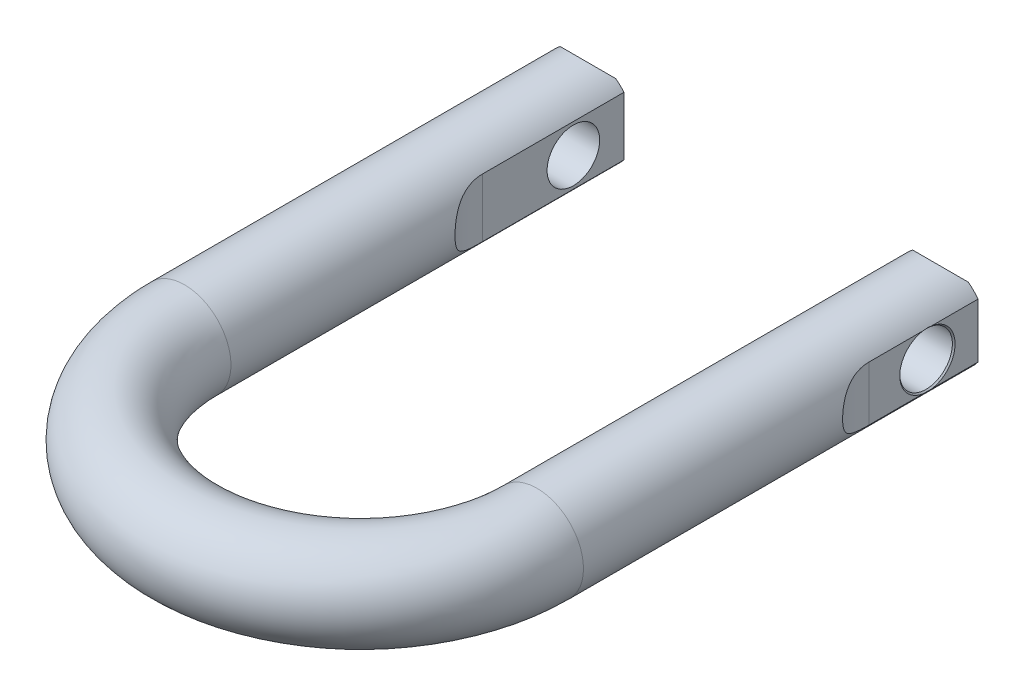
ISO-10303-21;
HEADER;
FILE_DESCRIPTION(('STEP AP214'),'2;1');
FILE_NAME('part.step','',(''),(''),'','','');
FILE_SCHEMA(('AUTOMOTIVE_DESIGN { 1 0 10303 214 1 1 1 1 }'));
ENDSEC;
DATA;
#1=APPLICATION_CONTEXT('core data for automotive mechanical design processes');
#2=APPLICATION_PROTOCOL_DEFINITION('international standard','automotive_design',2000,#1);
#3=PRODUCT_CONTEXT('',#1,'mechanical');
#4=PRODUCT('Part','Part','',(#3));
#5=PRODUCT_RELATED_PRODUCT_CATEGORY('part','',(#4));
#6=PRODUCT_DEFINITION_FORMATION('','',#4);
#7=PRODUCT_DEFINITION_CONTEXT('part definition',#1,'design');
#8=PRODUCT_DEFINITION('design','',#6,#7);
#9=PRODUCT_DEFINITION_SHAPE('','',#8);
#10=(LENGTH_UNIT() NAMED_UNIT(*) SI_UNIT(.MILLI.,.METRE.));
#11=(NAMED_UNIT(*) PLANE_ANGLE_UNIT() SI_UNIT($,.RADIAN.));
#12=(NAMED_UNIT(*) SI_UNIT($,.STERADIAN.) SOLID_ANGLE_UNIT());
#13=UNCERTAINTY_MEASURE_WITH_UNIT(LENGTH_MEASURE(1.E-05),#10,'distance_accuracy_value','');
#14=(GEOMETRIC_REPRESENTATION_CONTEXT(3) GLOBAL_UNCERTAINTY_ASSIGNED_CONTEXT((#13)) GLOBAL_UNIT_ASSIGNED_CONTEXT((#10,
#11,#12)) REPRESENTATION_CONTEXT('',''));
#15=CARTESIAN_POINT('',(0.,0.,0.));
#16=DIRECTION('',(0.,0.,1.));
#17=DIRECTION('',(1.,0.,0.));
#18=AXIS2_PLACEMENT_3D('',#15,#16,#17);
#19=CARTESIAN_POINT('',(73.1774,0.,0.));
#20=DIRECTION('',(1.,0.,0.));
#21=DIRECTION('',(0.,1.,0.));
#22=AXIS2_PLACEMENT_3D('',#19,#20,#21);
#23=CONICAL_SURFACE('',#22,9.4615,0.785398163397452);
#24=CARTESIAN_POINT('',(72.7159,0.,0.));
#25=DIRECTION('',(1.,0.,0.));
#26=DIRECTION('',(0.,1.,0.));
#27=AXIS2_PLACEMENT_3D('',#24,#25,#26);
#28=CIRCLE('',#27,9.);
#29=CARTESIAN_POINT('',(72.7159,9.,0.));
#30=VERTEX_POINT('',#29);
#31=EDGE_CURVE('E348',#30,#30,#28,.F.);
#32=ORIENTED_EDGE('',*,*,#31,.T.);
#33=EDGE_LOOP('',(#32));
#34=FACE_BOUND('',#33,.T.);
#35=CARTESIAN_POINT('',(73.1774,9.33583038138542,1.53696237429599));
#36=CARTESIAN_POINT('',(73.1597659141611,9.36004707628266,1.28153354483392));
#37=CARTESIAN_POINT('',(73.1464784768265,9.37821289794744,1.02522711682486));
#38=CARTESIAN_POINT('',(73.1287660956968,9.40237433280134,0.512611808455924));
#39=CARTESIAN_POINT('',(73.1243111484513,9.40841114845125,0.256305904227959));
#40=CARTESIAN_POINT('',(73.1243111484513,9.40841114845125,-0.256305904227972));
#41=CARTESIAN_POINT('',(73.1287660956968,9.40237433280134,-0.512611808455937));
#42=CARTESIAN_POINT('',(73.1464784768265,9.37821289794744,-1.02522711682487));
#43=CARTESIAN_POINT('',(73.1597659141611,9.36004707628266,-1.28153354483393));
#44=CARTESIAN_POINT('',(73.1774,9.33583038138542,-1.536962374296));
#45=B_SPLINE_CURVE_WITH_KNOTS('',3,(#35,#36,#37,#38,#39,#40,#41,#42,#43,#44),.UNSPECIFIED.,.F.,
.F.,(4,2,2,2,4),(0.,0.771435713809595,1.54024638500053,2.30905705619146,3.08049277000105),.UNSPECIFIED.);
#46=CARTESIAN_POINT('',(73.1774,9.33583038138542,1.53696237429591));
#47=VERTEX_POINT('',#46);
#48=CARTESIAN_POINT('',(73.1774,9.33583038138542,-1.53696237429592));
#49=VERTEX_POINT('',#48);
#50=EDGE_CURVE('E67',#47,#49,#45,.T.);
#51=ORIENTED_EDGE('',*,*,#50,.F.);
#52=CARTESIAN_POINT('',(73.1774,0.,0.));
#53=DIRECTION('',(1.,0.,0.));
#54=DIRECTION('',(0.,1.,0.));
#55=AXIS2_PLACEMENT_3D('',#52,#53,#54);
#56=CIRCLE('',#55,9.4615);
#57=CARTESIAN_POINT('',(73.1774,-9.33583038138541,1.53696237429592));
#58=VERTEX_POINT('',#57);
#59=EDGE_CURVE('E160',#47,#58,#56,.T.);
#60=ORIENTED_EDGE('',*,*,#59,.T.);
#61=CARTESIAN_POINT('',(73.1774,-9.33583038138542,-1.536962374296));
#62=CARTESIAN_POINT('',(73.1597659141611,-9.36004707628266,-1.28153354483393));
#63=CARTESIAN_POINT('',(73.1464784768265,-9.37821289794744,-1.02522711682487));
#64=CARTESIAN_POINT('',(73.1287660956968,-9.40237433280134,-0.512611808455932));
#65=CARTESIAN_POINT('',(73.1243111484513,-9.40841114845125,-0.256305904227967));
#66=CARTESIAN_POINT('',(73.1243111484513,-9.40841114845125,0.256305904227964));
#67=CARTESIAN_POINT('',(73.1287660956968,-9.40237433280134,0.512611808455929));
#68=CARTESIAN_POINT('',(73.1464784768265,-9.37821289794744,1.02522711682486));
#69=CARTESIAN_POINT('',(73.1597659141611,-9.36004707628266,1.28153354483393));
#70=CARTESIAN_POINT('',(73.1774,-9.33583038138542,1.536962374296));
#71=B_SPLINE_CURVE_WITH_KNOTS('',3,(#61,#62,#63,#64,#65,#66,#67,#68,#69,#70),.UNSPECIFIED.,.F.,
.F.,(4,2,2,2,4),(0.,0.771435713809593,1.54024638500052,2.30905705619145,3.08049277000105),.UNSPECIFIED.);
#72=CARTESIAN_POINT('',(73.1774,-9.33583038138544,-1.53696237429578));
#73=VERTEX_POINT('',#72);
#74=EDGE_CURVE('E346',#73,#58,#71,.T.);
#75=ORIENTED_EDGE('',*,*,#74,.F.);
#76=CARTESIAN_POINT('',(73.1774,0.,0.));
#77=DIRECTION('',(1.,0.,0.));
#78=DIRECTION('',(0.,1.,0.));
#79=AXIS2_PLACEMENT_3D('',#76,#77,#78);
#80=CIRCLE('',#79,9.4615);
#81=EDGE_CURVE('E158',#73,#49,#80,.T.);
#82=ORIENTED_EDGE('',*,*,#81,.T.);
#83=EDGE_LOOP('',(#51,#60,#75,#82));
#84=FACE_BOUND('',#83,.T.);
#85=ADVANCED_FACE('F14',(#34,#84),#23,.F.);
#86=CARTESIAN_POINT('',(-73.1774,0.,0.));
#87=DIRECTION('',(-1.,0.,0.));
#88=DIRECTION('',(0.,-1.,0.));
#89=AXIS2_PLACEMENT_3D('',#86,#87,#88);
#90=CONICAL_SURFACE('',#89,9.4615,0.785398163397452);
#91=CARTESIAN_POINT('',(-72.7159,0.,0.));
#92=DIRECTION('',(-1.,0.,0.));
#93=DIRECTION('',(0.,-1.,0.));
#94=AXIS2_PLACEMENT_3D('',#91,#92,#93);
#95=CIRCLE('',#94,9.);
#96=CARTESIAN_POINT('',(-72.7159,-9.,0.));
#97=VERTEX_POINT('',#96);
#98=EDGE_CURVE('E358',#97,#97,#95,.F.);
#99=ORIENTED_EDGE('',*,*,#98,.T.);
#100=EDGE_LOOP('',(#99));
#101=FACE_BOUND('',#100,.T.);
#102=CARTESIAN_POINT('',(-73.1774,-9.33583038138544,1.53696237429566));
#103=CARTESIAN_POINT('',(-73.1597659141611,-9.36004707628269,1.28153354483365));
#104=CARTESIAN_POINT('',(-73.1464784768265,-9.37821289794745,1.02522711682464));
#105=CARTESIAN_POINT('',(-73.1287660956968,-9.40237433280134,0.512611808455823));
#106=CARTESIAN_POINT('',(-73.1243111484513,-9.40841114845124,0.256305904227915));
#107=CARTESIAN_POINT('',(-73.1243111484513,-9.40841114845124,-0.256305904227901));
#108=CARTESIAN_POINT('',(-73.1287660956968,-9.40237433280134,-0.51261180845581));
#109=CARTESIAN_POINT('',(-73.1464784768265,-9.37821289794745,-1.02522711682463));
#110=CARTESIAN_POINT('',(-73.1597659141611,-9.36004707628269,-1.28153354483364));
#111=CARTESIAN_POINT('',(-73.1774,-9.33583038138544,-1.53696237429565));
#112=B_SPLINE_CURVE_WITH_KNOTS('',3,(#102,#103,#104,#105,#106,#107,#108,#109,#110,#111),
.UNSPECIFIED.,.F.,.F.,(4,2,2,2,4),(0.,0.77143571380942,1.54024638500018,2.30905705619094,
3.08049277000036),.UNSPECIFIED.);
#113=CARTESIAN_POINT('',(-73.1774,-9.33583038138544,1.53696237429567));
#114=VERTEX_POINT('',#113);
#115=CARTESIAN_POINT('',(-73.1774,-9.33583038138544,-1.53696237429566));
#116=VERTEX_POINT('',#115);
#117=EDGE_CURVE('E168',#114,#116,#112,.T.);
#118=ORIENTED_EDGE('',*,*,#117,.F.);
#119=CARTESIAN_POINT('',(-73.1774,0.,0.));
#120=DIRECTION('',(-1.,0.,0.));
#121=DIRECTION('',(0.,-1.,0.));
#122=AXIS2_PLACEMENT_3D('',#119,#120,#121);
#123=CIRCLE('',#122,9.4615);
#124=CARTESIAN_POINT('',(-73.1774,9.33583038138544,1.53696237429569));
#125=VERTEX_POINT('',#124);
#126=EDGE_CURVE('E150',#114,#125,#123,.T.);
#127=ORIENTED_EDGE('',*,*,#126,.T.);
#128=CARTESIAN_POINT('',(-73.1774,9.33583038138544,-1.53696237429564));
#129=CARTESIAN_POINT('',(-73.1597659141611,9.36004707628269,-1.28153354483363));
#130=CARTESIAN_POINT('',(-73.1464784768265,9.37821289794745,-1.02522711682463));
#131=CARTESIAN_POINT('',(-73.1287660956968,9.40237433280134,-0.512611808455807));
#132=CARTESIAN_POINT('',(-73.1243111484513,9.40841114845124,-0.256305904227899));
#133=CARTESIAN_POINT('',(-73.1243111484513,9.40841114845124,0.256305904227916));
#134=CARTESIAN_POINT('',(-73.1287660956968,9.40237433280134,0.512611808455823));
#135=CARTESIAN_POINT('',(-73.1464784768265,9.37821289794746,1.02522711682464));
#136=CARTESIAN_POINT('',(-73.1597659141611,9.36004707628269,1.28153354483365));
#137=CARTESIAN_POINT('',(-73.1774,9.33583038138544,1.53696237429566));
#138=B_SPLINE_CURVE_WITH_KNOTS('',3,(#128,#129,#130,#131,#132,#133,#134,#135,#136,#137),
.UNSPECIFIED.,.F.,.F.,(4,2,2,2,4),(0.,0.77143571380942,1.54024638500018,2.30905705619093,
3.08049277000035),.UNSPECIFIED.);
#139=CARTESIAN_POINT('',(-73.1774,9.33583038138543,-1.5369623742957));
#140=VERTEX_POINT('',#139);
#141=EDGE_CURVE('E33',#140,#125,#138,.T.);
#142=ORIENTED_EDGE('',*,*,#141,.F.);
#143=CARTESIAN_POINT('',(-73.1774,0.,0.));
#144=DIRECTION('',(-1.,0.,0.));
#145=DIRECTION('',(0.,-1.,0.));
#146=AXIS2_PLACEMENT_3D('',#143,#144,#145);
#147=CIRCLE('',#146,9.4615);
#148=EDGE_CURVE('E267',#140,#116,#147,.T.);
#149=ORIENTED_EDGE('',*,*,#148,.T.);
#150=EDGE_LOOP('',(#118,#127,#142,#149));
#151=FACE_BOUND('',#150,.T.);
#152=ADVANCED_FACE('F174',(#101,#151),#90,.F.);
#153=CARTESIAN_POINT('',(-88.9,-7.64764237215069,-22.3624576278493));
#154=DIRECTION('',(0.,0.707106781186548,0.707106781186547));
#155=DIRECTION('',(0.,-0.707106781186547,0.707106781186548));
#156=AXIS2_PLACEMENT_3D('',#153,#154,#155);
#157=PLANE('',#156);
#158=CARTESIAN_POINT('',(-60.3377,0.,-30.0101));
#159=DIRECTION('',(0.,0.707106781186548,0.707106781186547));
#160=DIRECTION('',(0.,0.707106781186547,-0.707106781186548));
#161=AXIS2_PLACEMENT_3D('',#158,#159,#160);
#162=ELLIPSE('',#161,22.4506403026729,15.875);
#163=CARTESIAN_POINT('',(-69.8627,-12.7,-17.3101));
#164=VERTEX_POINT('',#163);
#165=CARTESIAN_POINT('',(-50.8127,-12.7,-17.3101));
#166=VERTEX_POINT('',#165);
#167=EDGE_CURVE('E264',#164,#166,#162,.T.);
#168=ORIENTED_EDGE('',*,*,#167,.F.);
#169=DIRECTION('',(1.,0.,0.));
#170=VECTOR('',#169,1.);
#171=CARTESIAN_POINT('',(-60.3377,-12.7,-17.3101));
#172=LINE('',#171,#170);
#173=EDGE_CURVE('E271',#166,#164,#172,.F.);
#174=ORIENTED_EDGE('',*,*,#173,.F.);
#175=EDGE_LOOP('',(#168,#174));
#176=FACE_BOUND('',#175,.T.);
#177=ADVANCED_FACE('F382',(#176),#157,.F.);
#178=CARTESIAN_POINT('',(-88.9,-7.64764237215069,-22.3624576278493));
#179=DIRECTION('',(0.,0.707106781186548,0.707106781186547));
#180=DIRECTION('',(0.,-0.707106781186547,0.707106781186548));
#181=AXIS2_PLACEMENT_3D('',#178,#179,#180);
#182=PLANE('',#181);
#183=CARTESIAN_POINT('',(60.3377,0.,-30.0101));
#184=DIRECTION('',(0.,0.707106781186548,0.707106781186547));
#185=DIRECTION('',(0.,0.707106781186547,-0.707106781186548));
#186=AXIS2_PLACEMENT_3D('',#183,#184,#185);
#187=ELLIPSE('',#186,22.4506403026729,15.875);
#188=CARTESIAN_POINT('',(50.8127,-12.7,-17.3101));
#189=VERTEX_POINT('',#188);
#190=CARTESIAN_POINT('',(69.8627,-12.7,-17.3101));
#191=VERTEX_POINT('',#190);
#192=EDGE_CURVE('E129',#189,#191,#187,.T.);
#193=ORIENTED_EDGE('',*,*,#192,.F.);
#194=DIRECTION('',(1.,0.,0.));
#195=VECTOR('',#194,1.);
#196=CARTESIAN_POINT('',(60.3377,-12.7,-17.3101));
#197=LINE('',#196,#195);
#198=EDGE_CURVE('E132',#189,#191,#197,.T.);
#199=ORIENTED_EDGE('',*,*,#198,.T.);
#200=EDGE_LOOP('',(#193,#199));
#201=FACE_BOUND('',#200,.T.);
#202=ADVANCED_FACE('F131',(#201),#182,.F.);
#203=CARTESIAN_POINT('',(73.1774,25.4,-37.7792493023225));
#204=DIRECTION('',(-1.,0.,0.));
#205=DIRECTION('',(0.,0.,-1.));
#206=AXIS2_PLACEMENT_3D('',#203,#204,#205);
#207=PLANE('',#206);
#208=DIRECTION('',(0.,0.,-1.));
#209=VECTOR('',#208,1.);
#210=CARTESIAN_POINT('',(73.1774,9.33583038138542,120.7897));
#211=LINE('',#210,#209);
#212=CARTESIAN_POINT('',(73.1774,9.33583038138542,20.0279));
#213=VERTEX_POINT('',#212);
#214=EDGE_CURVE('E75',#213,#47,#211,.T.);
#215=ORIENTED_EDGE('',*,*,#214,.F.);
#216=DIRECTION('',(0.,-1.,0.));
#217=VECTOR('',#216,1.);
#218=CARTESIAN_POINT('',(73.1774,25.4,20.0279));
#219=LINE('',#218,#217);
#220=CARTESIAN_POINT('',(73.1774,-9.33583038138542,20.0279));
#221=VERTEX_POINT('',#220);
#222=EDGE_CURVE('E154',#213,#221,#219,.T.);
#223=ORIENTED_EDGE('',*,*,#222,.T.);
#224=DIRECTION('',(0.,0.,-1.));
#225=VECTOR('',#224,1.);
#226=CARTESIAN_POINT('',(73.1774,-9.33583038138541,120.7897));
#227=LINE('',#226,#225);
#228=EDGE_CURVE('E324',#58,#221,#227,.F.);
#229=ORIENTED_EDGE('',*,*,#228,.F.);
#230=ORIENTED_EDGE('',*,*,#59,.F.);
#231=EDGE_LOOP('',(#215,#223,#229,#230));
#232=FACE_BOUND('',#231,.T.);
#233=ADVANCED_FACE('F487',(#232),#207,.F.);
#234=CARTESIAN_POINT('',(73.1774,25.4,-37.7792493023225));
#235=DIRECTION('',(-1.,0.,0.));
#236=DIRECTION('',(0.,0.,-1.));
#237=AXIS2_PLACEMENT_3D('',#234,#235,#236);
#238=PLANE('',#237);
#239=DIRECTION('',(0.,0.,-1.));
#240=VECTOR('',#239,1.);
#241=CARTESIAN_POINT('',(73.1774,-9.33583038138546,120.7897));
#242=LINE('',#241,#240);
#243=CARTESIAN_POINT('',(73.1774,-9.33583038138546,-17.3101));
#244=VERTEX_POINT('',#243);
#245=EDGE_CURVE('E259',#244,#73,#242,.F.);
#246=ORIENTED_EDGE('',*,*,#245,.F.);
#247=DIRECTION('',(0.,-1.,0.));
#248=VECTOR('',#247,1.);
#249=CARTESIAN_POINT('',(73.1774,0.,-17.3101));
#250=LINE('',#249,#248);
#251=CARTESIAN_POINT('',(73.1774,9.33583038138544,-17.3101));
#252=VERTEX_POINT('',#251);
#253=EDGE_CURVE('E143',#244,#252,#250,.F.);
#254=ORIENTED_EDGE('',*,*,#253,.T.);
#255=DIRECTION('',(0.,0.,-1.));
#256=VECTOR('',#255,1.);
#257=CARTESIAN_POINT('',(73.1774,9.33583038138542,120.7897));
#258=LINE('',#257,#256);
#259=EDGE_CURVE('E258',#49,#252,#258,.T.);
#260=ORIENTED_EDGE('',*,*,#259,.F.);
#261=ORIENTED_EDGE('',*,*,#81,.F.);
#262=EDGE_LOOP('',(#246,#254,#260,#261));
#263=FACE_BOUND('',#262,.T.);
#264=ADVANCED_FACE('F478',(#263),#238,.F.);
#265=CARTESIAN_POINT('',(-88.9,7.64764237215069,-22.3624576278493));
#266=DIRECTION('',(0.,-0.707106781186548,0.707106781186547));
#267=DIRECTION('',(0.,-0.707106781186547,-0.707106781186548));
#268=AXIS2_PLACEMENT_3D('',#265,#266,#267);
#269=PLANE('',#268);
#270=CARTESIAN_POINT('',(60.3377,0.,-30.0101));
#271=DIRECTION('',(0.,-0.707106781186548,0.707106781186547));
#272=DIRECTION('',(0.,-0.707106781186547,-0.707106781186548));
#273=AXIS2_PLACEMENT_3D('',#270,#271,#272);
#274=ELLIPSE('',#273,22.4506403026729,15.875);
#275=CARTESIAN_POINT('',(69.8627,12.7,-17.3101));
#276=VERTEX_POINT('',#275);
#277=CARTESIAN_POINT('',(50.8127,12.7,-17.3101));
#278=VERTEX_POINT('',#277);
#279=EDGE_CURVE('E252',#276,#278,#274,.T.);
#280=ORIENTED_EDGE('',*,*,#279,.F.);
#281=DIRECTION('',(1.,0.,0.));
#282=VECTOR('',#281,1.);
#283=CARTESIAN_POINT('',(60.3377,12.7,-17.3101));
#284=LINE('',#283,#282);
#285=EDGE_CURVE('E144',#276,#278,#284,.F.);
#286=ORIENTED_EDGE('',*,*,#285,.T.);
#287=EDGE_LOOP('',(#280,#286));
#288=FACE_BOUND('',#287,.T.);
#289=ADVANCED_FACE('F470',(#288),#269,.F.);
#290=CARTESIAN_POINT('',(60.3377,0.,-17.3101));
#291=DIRECTION('',(0.,0.,1.));
#292=DIRECTION('',(0.,-1.,0.));
#293=AXIS2_PLACEMENT_3D('',#290,#291,#292);
#294=PLANE('',#293);
#295=ORIENTED_EDGE('',*,*,#253,.F.);
#296=CARTESIAN_POINT('',(60.3377,0.,-17.3101));
#297=DIRECTION('',(0.,0.,-1.));
#298=DIRECTION('',(1.,0.,0.));
#299=AXIS2_PLACEMENT_3D('',#296,#297,#298);
#300=CIRCLE('',#299,15.875);
#301=EDGE_CURVE('E136',#191,#244,#300,.F.);
#302=ORIENTED_EDGE('',*,*,#301,.F.);
#303=ORIENTED_EDGE('',*,*,#198,.F.);
#304=CARTESIAN_POINT('',(60.3377,0.,-17.3101));
#305=DIRECTION('',(0.,0.,-1.));
#306=DIRECTION('',(1.,0.,0.));
#307=AXIS2_PLACEMENT_3D('',#304,#305,#306);
#308=CIRCLE('',#307,15.875);
#309=CARTESIAN_POINT('',(48.0314,-10.0284896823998,-17.3101));
#310=VERTEX_POINT('',#309);
#311=EDGE_CURVE('E142',#310,#189,#308,.F.);
#312=ORIENTED_EDGE('',*,*,#311,.F.);
#313=DIRECTION('',(0.,1.,0.));
#314=VECTOR('',#313,1.);
#315=CARTESIAN_POINT('',(48.0314,25.4,-17.3101));
#316=LINE('',#315,#314);
#317=CARTESIAN_POINT('',(48.0314,10.0284896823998,-17.3101));
#318=VERTEX_POINT('',#317);
#319=EDGE_CURVE('E298',#310,#318,#316,.T.);
#320=ORIENTED_EDGE('',*,*,#319,.T.);
#321=CARTESIAN_POINT('',(60.3377,0.,-17.3101));
#322=DIRECTION('',(0.,0.,-1.));
#323=DIRECTION('',(1.,0.,0.));
#324=AXIS2_PLACEMENT_3D('',#321,#322,#323);
#325=CIRCLE('',#324,15.875);
#326=EDGE_CURVE('E249',#278,#318,#325,.F.);
#327=ORIENTED_EDGE('',*,*,#326,.F.);
#328=ORIENTED_EDGE('',*,*,#285,.F.);
#329=CARTESIAN_POINT('',(60.3377,0.,-17.3101));
#330=DIRECTION('',(0.,0.,-1.));
#331=DIRECTION('',(1.,0.,0.));
#332=AXIS2_PLACEMENT_3D('',#329,#330,#331);
#333=CIRCLE('',#332,15.875);
#334=EDGE_CURVE('E255',#252,#276,#333,.F.);
#335=ORIENTED_EDGE('',*,*,#334,.F.);
#336=EDGE_LOOP('',(#295,#302,#303,#312,#320,#327,#328,#335));
#337=FACE_BOUND('',#336,.T.);
#338=ADVANCED_FACE('F141',(#337),#294,.F.);
#339=CARTESIAN_POINT('',(48.0314,25.4,-33.8404776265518));
#340=DIRECTION('',(1.,0.,0.));
#341=DIRECTION('',(0.,1.,0.));
#342=AXIS2_PLACEMENT_3D('',#339,#340,#341);
#343=PLANE('',#342);
#344=CARTESIAN_POINT('',(48.0314,0.,0.));
#345=DIRECTION('',(1.,0.,0.));
#346=DIRECTION('',(0.,1.,0.));
#347=AXIS2_PLACEMENT_3D('',#344,#345,#346);
#348=CIRCLE('',#347,9.);
#349=CARTESIAN_POINT('',(48.0314,9.,0.));
#350=VERTEX_POINT('',#349);
#351=EDGE_CURVE('E363',#350,#350,#348,.T.);
#352=ORIENTED_EDGE('',*,*,#351,.T.);
#353=EDGE_LOOP('',(#352));
#354=FACE_BOUND('',#353,.T.);
#355=DIRECTION('',(0.,0.,-1.));
#356=VECTOR('',#355,1.);
#357=CARTESIAN_POINT('',(48.0314,-10.0284896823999,120.7897));
#358=LINE('',#357,#356);
#359=CARTESIAN_POINT('',(48.0314,-10.0284896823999,31.1023));
#360=VERTEX_POINT('',#359);
#361=EDGE_CURVE('E149',#360,#310,#358,.T.);
#362=ORIENTED_EDGE('',*,*,#361,.F.);
#363=DIRECTION('',(0.,-1.,0.));
#364=VECTOR('',#363,1.);
#365=CARTESIAN_POINT('',(48.0314,25.4,31.1023));
#366=LINE('',#365,#364);
#367=CARTESIAN_POINT('',(48.0314,10.0284896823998,31.1023));
#368=VERTEX_POINT('',#367);
#369=EDGE_CURVE('E293',#360,#368,#366,.F.);
#370=ORIENTED_EDGE('',*,*,#369,.T.);
#371=DIRECTION('',(0.,0.,-1.));
#372=VECTOR('',#371,1.);
#373=CARTESIAN_POINT('',(48.0314,10.0284896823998,120.7897));
#374=LINE('',#373,#372);
#375=EDGE_CURVE('E248',#318,#368,#374,.F.);
#376=ORIENTED_EDGE('',*,*,#375,.F.);
#377=ORIENTED_EDGE('',*,*,#319,.F.);
#378=EDGE_LOOP('',(#362,#370,#376,#377));
#379=FACE_BOUND('',#378,.T.);
#380=ADVANCED_FACE('F456',(#354,#379),#343,.F.);
#381=CARTESIAN_POINT('',(22.6314,25.4,31.1023));
#382=DIRECTION('',(0.,-1.,0.));
#383=DIRECTION('',(1.,0.,0.));
#384=AXIS2_PLACEMENT_3D('',#381,#382,#383);
#385=CYLINDRICAL_SURFACE('',#384,25.4);
#386=ORIENTED_EDGE('',*,*,#369,.F.);
#387=CARTESIAN_POINT('',(48.0314,10.0284896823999,31.1023));
#388=CARTESIAN_POINT('',(48.031401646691,10.0284842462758,31.3084763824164));
#389=CARTESIAN_POINT('',(48.0288890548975,10.0254094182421,31.5146320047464));
#390=CARTESIAN_POINT('',(48.0188559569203,10.0130812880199,31.9266410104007));
#391=CARTESIAN_POINT('',(48.0113353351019,10.003827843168,32.1324943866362));
#392=CARTESIAN_POINT('',(47.9812870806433,9.96673363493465,32.7493058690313));
#393=CARTESIAN_POINT('',(47.9512730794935,9.92955895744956,33.1594046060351));
#394=CARTESIAN_POINT('',(47.8714054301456,9.82910331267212,33.978622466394));
#395=CARTESIAN_POINT('',(47.8213563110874,9.76556490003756,34.3876907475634));
#396=CARTESIAN_POINT('',(47.7023824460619,9.61113339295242,35.1978329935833));
#397=CARTESIAN_POINT('',(47.6334600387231,9.52024368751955,35.598907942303));
#398=CARTESIAN_POINT('',(47.477888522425,9.30903602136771,36.3915087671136));
#399=CARTESIAN_POINT('',(47.3911708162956,9.18860381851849,36.7829909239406));
#400=CARTESIAN_POINT('',(47.2022725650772,8.91647941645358,37.5512266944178));
#401=CARTESIAN_POINT('',(47.1000897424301,8.76478261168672,37.9279781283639));
#402=CARTESIAN_POINT('',(46.8836876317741,8.42881452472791,38.6608620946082));
#403=CARTESIAN_POINT('',(46.7695262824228,8.24469736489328,39.0170820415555));
#404=CARTESIAN_POINT('',(46.5326067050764,7.84153131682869,39.7060677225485));
#405=CARTESIAN_POINT('',(46.4098532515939,7.62250174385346,40.0388462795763));
#406=CARTESIAN_POINT('',(46.2018078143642,7.22663765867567,40.5705887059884));
#407=CARTESIAN_POINT('',(46.1175415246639,7.0597783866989,40.7774321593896));
#408=CARTESIAN_POINT('',(45.949039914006,6.70968059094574,41.1767512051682));
#409=CARTESIAN_POINT('',(45.8648045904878,6.52644603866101,41.3692302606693));
#410=CARTESIAN_POINT('',(45.6982030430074,6.14364120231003,41.7382588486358));
#411=CARTESIAN_POINT('',(45.6158374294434,5.94406567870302,41.9148032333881));
#412=CARTESIAN_POINT('',(45.4550179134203,5.52909585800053,42.2502627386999));
#413=CARTESIAN_POINT('',(45.3765640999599,5.31370120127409,42.4091774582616));
#414=CARTESIAN_POINT('',(45.2250616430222,4.86621063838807,42.7089749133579));
#415=CARTESIAN_POINT('',(45.1520605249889,4.63399637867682,42.8497055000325));
#416=CARTESIAN_POINT('',(45.0142814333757,4.1557634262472,43.1101448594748));
#417=CARTESIAN_POINT('',(44.949502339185,3.90974662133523,43.2298564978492));
#418=CARTESIAN_POINT('',(44.8302288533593,3.40600003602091,43.4468263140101));
#419=CARTESIAN_POINT('',(44.7757204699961,3.14828679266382,43.5441150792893));
#420=CARTESIAN_POINT('',(44.6786464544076,2.62315961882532,43.7153330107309));
#421=CARTESIAN_POINT('',(44.6360761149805,2.3557495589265,43.7892713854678));
#422=CARTESIAN_POINT('',(44.5551824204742,1.74498806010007,43.92867631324));
#423=CARTESIAN_POINT('',(44.520654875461,1.39953190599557,43.9872731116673));
#424=CARTESIAN_POINT('',(44.4744168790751,0.702681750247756,44.065506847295));
#425=CARTESIAN_POINT('',(44.4627071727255,0.351287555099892,44.0851425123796));
#426=CARTESIAN_POINT('',(44.4626947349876,-0.25785642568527,44.0851519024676));
#427=CARTESIAN_POINT('',(44.4689948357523,-0.51565539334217,44.0745790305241));
#428=CARTESIAN_POINT('',(44.4940024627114,-1.02901766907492,44.032390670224));
#429=CARTESIAN_POINT('',(44.5127134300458,-1.28458033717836,44.00076934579));
#430=CARTESIAN_POINT('',(44.5620345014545,-1.79134049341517,43.9167304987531));
#431=CARTESIAN_POINT('',(44.5926562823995,-2.04253344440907,43.8642925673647));
#432=CARTESIAN_POINT('',(44.6649181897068,-2.53815854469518,43.7391227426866));
#433=CARTESIAN_POINT('',(44.7065575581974,-2.78259115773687,43.6663922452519));
#434=CARTESIAN_POINT('',(44.7995084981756,-3.26183787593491,43.5016492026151));
#435=CARTESIAN_POINT('',(44.8507812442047,-3.49668613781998,43.4097138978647));
#436=CARTESIAN_POINT('',(44.9617307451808,-3.95614175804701,43.2072428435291));
#437=CARTESIAN_POINT('',(45.0214076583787,-4.18074892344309,43.0967067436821));
#438=CARTESIAN_POINT('',(45.1476074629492,-4.61828407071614,42.8580899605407));
#439=CARTESIAN_POINT('',(45.2141278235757,-4.83121632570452,42.7300157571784));
#440=CARTESIAN_POINT('',(45.3524408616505,-5.24453560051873,42.4573722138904));
#441=CARTESIAN_POINT('',(45.424235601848,-5.44491765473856,42.3127964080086));
#442=CARTESIAN_POINT('',(45.5697887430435,-5.82799058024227,42.0118201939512));
#443=CARTESIAN_POINT('',(45.6434675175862,-6.01097654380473,41.8557558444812));
#444=CARTESIAN_POINT('',(45.7927860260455,-6.36378868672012,41.5302555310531));
#445=CARTESIAN_POINT('',(45.868425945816,-6.53361361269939,41.3608182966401));
#446=CARTESIAN_POINT('',(46.0202476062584,-6.85992514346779,41.0097906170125));
#447=CARTESIAN_POINT('',(46.0964293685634,-7.01641121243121,40.8281996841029));
#448=CARTESIAN_POINT('',(46.2480164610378,-7.31605318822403,40.454100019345));
#449=CARTESIAN_POINT('',(46.323421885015,-7.45921072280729,40.2615926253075));
#450=CARTESIAN_POINT('',(46.4848429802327,-7.75545230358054,39.8335083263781));
#451=CARTESIAN_POINT('',(46.5705051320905,-7.90614332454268,39.5961405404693));
#452=CARTESIAN_POINT('',(46.7375430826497,-8.19014681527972,39.1097964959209));
#453=CARTESIAN_POINT('',(46.8189184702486,-8.32345762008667,38.8608191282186));
#454=CARTESIAN_POINT('',(46.9760587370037,-8.57344654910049,38.352704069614));
#455=CARTESIAN_POINT('',(47.0518192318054,-8.69011174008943,38.0935586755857));
#456=CARTESIAN_POINT('',(47.1965210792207,-8.90741695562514,37.5667776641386));
#457=CARTESIAN_POINT('',(47.2654616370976,-9.00805511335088,37.2991410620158));
#458=CARTESIAN_POINT('',(47.4093219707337,-9.21366365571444,36.6994964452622));
#459=CARTESIAN_POINT('',(47.4824319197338,-9.31506409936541,36.3658260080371));
#460=CARTESIAN_POINT('',(47.6159832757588,-9.49664364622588,35.6902438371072));
#461=CARTESIAN_POINT('',(47.6764221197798,-9.57681845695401,35.348330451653));
#462=CARTESIAN_POINT('',(47.7836565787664,-9.71696478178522,34.6583981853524));
#463=CARTESIAN_POINT('',(47.8304559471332,-9.77694185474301,34.3103810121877));
#464=CARTESIAN_POINT('',(47.9097565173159,-9.87754675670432,33.6100593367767));
#465=CARTESIAN_POINT('',(47.9422619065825,-9.91818025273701,33.2577561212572));
#466=CARTESIAN_POINT('',(47.9886984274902,-9.97592008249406,32.6047805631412));
#467=CARTESIAN_POINT('',(48.0047150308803,-9.99568070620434,32.3044854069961));
#468=CARTESIAN_POINT('',(48.0260628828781,-10.0219391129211,31.7035607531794));
#469=CARTESIAN_POINT('',(48.0314162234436,-10.0284643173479,31.4029332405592));
#470=CARTESIAN_POINT('',(48.0314,-10.0284896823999,31.1023));
#471=B_SPLINE_CURVE_WITH_KNOTS('',3,(#387,#388,#389,#390,#391,#392,#393,#394,#395,#396,#397,
#398,#399,#400,#401,#402,#403,#404,#405,#406,#407,#408,#409,#410,#411,#412,#413,#414,#415,#416,
#417,#418,#419,#420,#421,#422,#423,#424,#425,#426,#427,#428,#429,#430,#431,#432,#433,#434,#435,
#436,#437,#438,#439,#440,#441,#442,#443,#444,#445,#446,#447,#448,#449,#450,#451,#452,#453,#454,
#455,#456,#457,#458,#459,#460,#461,#462,#463,#464,#465,#466,#467,#468,#469,#470),.UNSPECIFIED.,
.F.,.F.,(4,2,2,2,2,2,2,2,2,2,2,2,2,2,2,2,2,2,2,2,2,2,2,2,2,2,2,2,2,2,2,2,2,2,2,2,2,2,2,2,2,4),
(0.,0.618449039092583,1.23691235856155,2.4741702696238,3.72380563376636,4.97328622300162,
6.22767696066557,7.48225261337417,8.73101771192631,9.97909431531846,10.814729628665,
11.6501628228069,12.4858649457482,13.3215860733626,14.1639003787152,15.006099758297,
15.8471433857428,16.6878549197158,17.7411503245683,18.7944801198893,19.5676582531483,
20.3410508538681,21.1152035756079,21.8893030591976,22.660347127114,23.4314057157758,
24.2021801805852,24.9732577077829,25.7271202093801,26.4810544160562,27.2350188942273,
27.9888911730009,28.8698121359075,29.7508174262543,30.6325035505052,31.5142922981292,
32.5822200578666,33.6503636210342,34.7182129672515,35.7857492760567,36.6893910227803,
37.5911586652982),.UNSPECIFIED.);
#472=EDGE_CURVE('E124',#368,#360,#471,.T.);
#473=ORIENTED_EDGE('',*,*,#472,.F.);
#474=EDGE_LOOP('',(#386,#473));
#475=FACE_BOUND('',#474,.T.);
#476=ADVANCED_FACE('F231',(#475),#385,.F.);
#477=CARTESIAN_POINT('',(98.5774,25.4,20.0279));
#478=DIRECTION('',(0.,-1.,0.));
#479=DIRECTION('',(1.,0.,0.));
#480=AXIS2_PLACEMENT_3D('',#477,#478,#479);
#481=CYLINDRICAL_SURFACE('',#480,25.4);
#482=ORIENTED_EDGE('',*,*,#222,.F.);
#483=CARTESIAN_POINT('',(73.1774,-9.33583038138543,20.0279));
#484=CARTESIAN_POINT('',(73.1773985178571,-9.33582584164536,20.2172772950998));
#485=CARTESIAN_POINT('',(73.179518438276,-9.3329177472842,20.4066360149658));
#486=CARTESIAN_POINT('',(73.1879830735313,-9.32126194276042,20.7850831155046));
#487=CARTESIAN_POINT('',(73.1943278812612,-9.31251410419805,20.9741714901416));
#488=CARTESIAN_POINT('',(73.2196766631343,-9.27745661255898,21.5407623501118));
#489=CARTESIAN_POINT('',(73.2449949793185,-9.24233295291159,21.9174965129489));
#490=CARTESIAN_POINT('',(73.3123339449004,-9.14756251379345,22.6699625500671));
#491=CARTESIAN_POINT('',(73.3545092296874,-9.08768851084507,23.045651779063));
#492=CARTESIAN_POINT('',(73.4547356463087,-8.94241553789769,23.7899033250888));
#493=CARTESIAN_POINT('',(73.5127849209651,-8.85701955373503,24.1584664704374));
#494=CARTESIAN_POINT('',(73.6437580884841,-8.65901781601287,24.8870109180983));
#495=CARTESIAN_POINT('',(73.7167347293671,-8.54631530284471,25.2469565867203));
#496=CARTESIAN_POINT('',(73.8756700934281,-8.29225207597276,25.9537518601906));
#497=CARTESIAN_POINT('',(73.9616305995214,-8.15088742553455,26.3005996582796));
#498=CARTESIAN_POINT('',(74.1437161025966,-7.83850044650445,26.9760601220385));
#499=CARTESIAN_POINT('',(74.2397965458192,-7.6676061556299,27.3047437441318));
#500=CARTESIAN_POINT('',(74.4392628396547,-7.2942640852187,27.9412692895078));
#501=CARTESIAN_POINT('',(74.5426449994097,-7.09183218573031,28.2491215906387));
#502=CARTESIAN_POINT('',(74.7195098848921,-6.72358919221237,28.7461063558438));
#503=CARTESIAN_POINT('',(74.7921131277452,-6.56643123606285,28.9420040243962));
#504=CARTESIAN_POINT('',(74.9374038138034,-6.23672418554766,29.3204575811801));
#505=CARTESIAN_POINT('',(75.0100912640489,-6.06417369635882,29.5030122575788));
#506=CARTESIAN_POINT('',(75.1539083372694,-5.70379102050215,29.8531679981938));
#507=CARTESIAN_POINT('',(75.225037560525,-5.51595496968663,30.0207652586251));
#508=CARTESIAN_POINT('',(75.3639329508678,-5.12551106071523,30.3393082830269));
#509=CARTESIAN_POINT('',(75.4316996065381,-4.92290535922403,30.4902564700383));
#510=CARTESIAN_POINT('',(75.5625942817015,-4.50191170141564,30.7751563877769));
#511=CARTESIAN_POINT('',(75.6256774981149,-4.28340321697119,30.9089511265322));
#512=CARTESIAN_POINT('',(75.7446375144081,-3.83353539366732,31.156413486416));
#513=CARTESIAN_POINT('',(75.8005180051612,-3.60218272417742,31.2700914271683));
#514=CARTESIAN_POINT('',(75.9032594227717,-3.12851518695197,31.4758947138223));
#515=CARTESIAN_POINT('',(75.9501323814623,-2.88621548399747,31.5680488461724));
#516=CARTESIAN_POINT('',(76.0333637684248,-2.39257372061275,31.7298101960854));
#517=CARTESIAN_POINT('',(76.0697267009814,-2.14123558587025,31.799427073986));
#518=CARTESIAN_POINT('',(76.1370368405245,-1.57876665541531,31.927330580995));
#519=CARTESIAN_POINT('',(76.165285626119,-1.26607014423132,31.9802510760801));
#520=CARTESIAN_POINT('',(76.2031154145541,-0.635556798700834,32.0509210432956));
#521=CARTESIAN_POINT('',(76.2126948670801,-0.317739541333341,32.0686675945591));
#522=CARTESIAN_POINT('',(76.2127039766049,0.246160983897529,32.0686756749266));
#523=CARTESIAN_POINT('',(76.20696144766,0.492275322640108,32.0580304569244));
#524=CARTESIAN_POINT('',(76.1841805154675,0.982245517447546,32.0155737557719));
#525=CARTESIAN_POINT('',(76.167138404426,1.22610060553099,31.9837553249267));
#526=CARTESIAN_POINT('',(76.1222636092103,1.70943628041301,31.8992573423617));
#527=CARTESIAN_POINT('',(76.0944184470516,1.94891147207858,31.8465536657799));
#528=CARTESIAN_POINT('',(76.0288091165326,2.42105895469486,31.7208920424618));
#529=CARTESIAN_POINT('',(75.9910457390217,2.6537317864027,31.6479357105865));
#530=CARTESIAN_POINT('',(75.9069385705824,3.10931689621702,31.4829728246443));
#531=CARTESIAN_POINT('',(75.8606361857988,3.33227011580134,31.3910579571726));
#532=CARTESIAN_POINT('',(75.7606641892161,3.76799396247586,31.1889603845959));
#533=CARTESIAN_POINT('',(75.706994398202,3.98076434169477,31.0787772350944));
#534=CARTESIAN_POINT('',(75.5937701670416,4.39476819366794,30.8413186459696));
#535=CARTESIAN_POINT('',(75.5342179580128,4.59600599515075,30.7140496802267));
#536=CARTESIAN_POINT('',(75.4107260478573,4.98612350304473,30.4436272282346));
#537=CARTESIAN_POINT('',(75.3467845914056,5.17499820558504,30.3004673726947));
#538=CARTESIAN_POINT('',(75.1554583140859,5.70866012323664,29.8600988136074));
#539=CARTESIAN_POINT('',(75.02415140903,6.03587312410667,29.5429933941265));
#540=CARTESIAN_POINT('',(74.761258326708,6.63968735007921,28.8643968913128));
#541=CARTESIAN_POINT('',(74.6296721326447,6.91628543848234,28.5029030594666));
#542=CARTESIAN_POINT('',(74.4269249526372,7.31690257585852,27.9000442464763));
#543=CARTESIAN_POINT('',(74.353072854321,7.45703978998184,27.6700582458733));
#544=CARTESIAN_POINT('',(74.2095966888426,7.72066416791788,27.1994130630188));
#545=CARTESIAN_POINT('',(74.1399730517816,7.84414963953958,26.9587527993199));
#546=CARTESIAN_POINT('',(74.0061249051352,8.07512339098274,26.4681774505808));
#547=CARTESIAN_POINT('',(73.9419053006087,8.18259720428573,26.2182542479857));
#548=CARTESIAN_POINT('',(73.8199134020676,8.38207670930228,25.710767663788));
#549=CARTESIAN_POINT('',(73.762141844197,8.47408063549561,25.4532034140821));
#550=CARTESIAN_POINT('',(73.6423669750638,8.66119608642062,24.8764323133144));
#551=CARTESIAN_POINT('',(73.5820654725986,8.75282704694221,24.5557389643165));
#552=CARTESIAN_POINT('',(73.4732230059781,8.91533595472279,23.9071381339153));
#553=CARTESIAN_POINT('',(73.4246846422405,8.98620931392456,23.5792290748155));
#554=CARTESIAN_POINT('',(73.3402039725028,9.10801860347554,22.9183742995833));
#555=CARTESIAN_POINT('',(73.3042533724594,9.15896766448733,22.5854320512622));
#556=CARTESIAN_POINT('',(73.2454564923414,9.24164615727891,21.9161358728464));
#557=CARTESIAN_POINT('',(73.2226054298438,9.27338260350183,21.5797832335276));
#558=CARTESIAN_POINT('',(73.1967794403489,9.30913302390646,21.0403689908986));
#559=CARTESIAN_POINT('',(73.1895093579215,9.31915943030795,20.8378822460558));
#560=CARTESIAN_POINT('',(73.1798221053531,9.33249964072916,20.4329015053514));
#561=CARTESIAN_POINT('',(73.1773970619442,9.33582433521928,20.2304080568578));
#562=CARTESIAN_POINT('',(73.1774,9.33583038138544,20.0279));
#563=B_SPLINE_CURVE_WITH_KNOTS('',3,(#483,#484,#485,#486,#487,#488,#489,#490,#491,#492,#493,
#494,#495,#496,#497,#498,#499,#500,#501,#502,#503,#504,#505,#506,#507,#508,#509,#510,#511,#512,
#513,#514,#515,#516,#517,#518,#519,#520,#521,#522,#523,#524,#525,#526,#527,#528,#529,#530,#531,
#532,#533,#534,#535,#536,#537,#538,#539,#540,#541,#542,#543,#544,#545,#546,#547,#548,#549,#550,
#551,#552,#553,#554,#555,#556,#557,#558,#559,#560,#561,#562),.UNSPECIFIED.,.F.,.F.,(4,2,2,2,2,2,
2,2,2,2,2,2,2,2,2,2,2,2,2,2,2,2,2,2,2,2,2,2,2,2,2,2,2,2,2,2,2,2,2,4),(0.,0.568060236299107,
1.13613296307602,2.27255985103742,3.41966008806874,4.56662617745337,5.71771751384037,
6.86896705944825,8.01534471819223,9.16114699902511,9.94473435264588,10.7283927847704,
11.5122499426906,12.2959928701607,13.0864623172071,13.8765250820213,14.6655250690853,
15.454186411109,16.4068411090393,17.3595749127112,18.0976822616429,18.8360319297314,
19.5752369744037,20.3143830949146,21.0500350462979,21.7857048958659,22.5210967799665,
23.256784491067,24.6736950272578,26.0906933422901,26.9278115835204,27.7650148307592,
28.6029699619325,29.4410206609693,30.4568396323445,31.4728829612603,32.4882555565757,
33.5032572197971,34.111699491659,34.7191522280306),.UNSPECIFIED.);
#564=EDGE_CURVE('E235',#221,#213,#563,.T.);
#565=ORIENTED_EDGE('',*,*,#564,.F.);
#566=EDGE_LOOP('',(#482,#565));
#567=FACE_BOUND('',#566,.T.);
#568=ADVANCED_FACE('F226',(#567),#481,.F.);
#569=CARTESIAN_POINT('',(-73.1774,25.4,-37.7792493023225));
#570=DIRECTION('',(1.,0.,0.));
#571=DIRECTION('',(0.,1.,0.));
#572=AXIS2_PLACEMENT_3D('',#569,#570,#571);
#573=PLANE('',#572);
#574=DIRECTION('',(0.,0.,-1.));
#575=VECTOR('',#574,1.);
#576=CARTESIAN_POINT('',(-73.1774,-9.33583038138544,120.7897));
#577=LINE('',#576,#575);
#578=CARTESIAN_POINT('',(-73.1774,-9.33583038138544,20.0279));
#579=VERTEX_POINT('',#578);
#580=EDGE_CURVE('E266',#579,#114,#577,.T.);
#581=ORIENTED_EDGE('',*,*,#580,.F.);
#582=DIRECTION('',(0.,-1.,0.));
#583=VECTOR('',#582,1.);
#584=CARTESIAN_POINT('',(-73.1774,25.4,20.0279));
#585=LINE('',#584,#583);
#586=CARTESIAN_POINT('',(-73.1774,9.33583038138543,20.0279));
#587=VERTEX_POINT('',#586);
#588=EDGE_CURVE('E152',#579,#587,#585,.F.);
#589=ORIENTED_EDGE('',*,*,#588,.T.);
#590=DIRECTION('',(0.,0.,-1.));
#591=VECTOR('',#590,1.);
#592=CARTESIAN_POINT('',(-73.1774,9.33583038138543,120.7897));
#593=LINE('',#592,#591);
#594=EDGE_CURVE('E242',#125,#587,#593,.F.);
#595=ORIENTED_EDGE('',*,*,#594,.F.);
#596=ORIENTED_EDGE('',*,*,#126,.F.);
#597=EDGE_LOOP('',(#581,#589,#595,#596));
#598=FACE_BOUND('',#597,.T.);
#599=ADVANCED_FACE('F222',(#598),#573,.F.);
#600=CARTESIAN_POINT('',(-98.5774,25.4,20.0279));
#601=DIRECTION('',(0.,-1.,0.));
#602=DIRECTION('',(1.,0.,0.));
#603=AXIS2_PLACEMENT_3D('',#600,#601,#602);
#604=CYLINDRICAL_SURFACE('',#603,25.4);
#605=ORIENTED_EDGE('',*,*,#588,.F.);
#606=CARTESIAN_POINT('',(-73.1774,9.33583038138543,20.0279));
#607=CARTESIAN_POINT('',(-73.1773985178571,9.33582584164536,20.2172772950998));
#608=CARTESIAN_POINT('',(-73.179518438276,9.3329177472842,20.4066360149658));
#609=CARTESIAN_POINT('',(-73.1879830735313,9.32126194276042,20.7850831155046));
#610=CARTESIAN_POINT('',(-73.1943278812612,9.31251410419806,20.9741714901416));
#611=CARTESIAN_POINT('',(-73.2196766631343,9.27745661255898,21.5407623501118));
#612=CARTESIAN_POINT('',(-73.2449949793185,9.24233295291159,21.9174965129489));
#613=CARTESIAN_POINT('',(-73.3123339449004,9.14756251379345,22.6699625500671));
#614=CARTESIAN_POINT('',(-73.3545092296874,9.08768851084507,23.045651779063));
#615=CARTESIAN_POINT('',(-73.4547356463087,8.94241553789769,23.7899033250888));
#616=CARTESIAN_POINT('',(-73.5127849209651,8.85701955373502,24.1584664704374));
#617=CARTESIAN_POINT('',(-73.6437580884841,8.65901781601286,24.8870109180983));
#618=CARTESIAN_POINT('',(-73.7167347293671,8.5463153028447,25.2469565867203));
#619=CARTESIAN_POINT('',(-73.8756700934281,8.29225207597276,25.9537518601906));
#620=CARTESIAN_POINT('',(-73.9616305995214,8.15088742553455,26.3005996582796));
#621=CARTESIAN_POINT('',(-74.1437161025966,7.83850044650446,26.9760601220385));
#622=CARTESIAN_POINT('',(-74.2397965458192,7.6676061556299,27.3047437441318));
#623=CARTESIAN_POINT('',(-74.4392628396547,7.2942640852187,27.9412692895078));
#624=CARTESIAN_POINT('',(-74.5426449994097,7.09183218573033,28.2491215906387));
#625=CARTESIAN_POINT('',(-74.7195098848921,6.72358919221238,28.7461063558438));
#626=CARTESIAN_POINT('',(-74.7921131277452,6.56643123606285,28.9420040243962));
#627=CARTESIAN_POINT('',(-74.9374038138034,6.23672418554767,29.3204575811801));
#628=CARTESIAN_POINT('',(-75.0100912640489,6.06417369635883,29.5030122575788));
#629=CARTESIAN_POINT('',(-75.1539083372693,5.70379102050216,29.8531679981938));
#630=CARTESIAN_POINT('',(-75.2250375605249,5.51595496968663,30.0207652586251));
#631=CARTESIAN_POINT('',(-75.3639329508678,5.12551106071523,30.3393082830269));
#632=CARTESIAN_POINT('',(-75.4316996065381,4.92290535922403,30.4902564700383));
#633=CARTESIAN_POINT('',(-75.5625942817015,4.50191170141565,30.7751563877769));
#634=CARTESIAN_POINT('',(-75.6256774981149,4.2834032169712,30.9089511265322));
#635=CARTESIAN_POINT('',(-75.7446375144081,3.83353539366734,31.156413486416));
#636=CARTESIAN_POINT('',(-75.8005180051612,3.60218272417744,31.2700914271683));
#637=CARTESIAN_POINT('',(-75.9032594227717,3.12851518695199,31.4758947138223));
#638=CARTESIAN_POINT('',(-75.9501323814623,2.8862154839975,31.5680488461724));
#639=CARTESIAN_POINT('',(-76.0333637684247,2.39257372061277,31.7298101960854));
#640=CARTESIAN_POINT('',(-76.0697267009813,2.14123558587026,31.799427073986));
#641=CARTESIAN_POINT('',(-76.1370368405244,1.57876665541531,31.927330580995));
#642=CARTESIAN_POINT('',(-76.165285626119,1.26607014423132,31.9802510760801));
#643=CARTESIAN_POINT('',(-76.2031154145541,0.63555679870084,32.0509210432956));
#644=CARTESIAN_POINT('',(-76.2126948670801,0.317739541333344,32.0686675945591));
#645=CARTESIAN_POINT('',(-76.2127039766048,-0.246160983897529,32.0686756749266));
#646=CARTESIAN_POINT('',(-76.20696144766,-0.492275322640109,32.0580304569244));
#647=CARTESIAN_POINT('',(-76.1841805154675,-0.982245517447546,32.0155737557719));
#648=CARTESIAN_POINT('',(-76.167138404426,-1.22610060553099,31.9837553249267));
#649=CARTESIAN_POINT('',(-76.1222636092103,-1.70943628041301,31.8992573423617));
#650=CARTESIAN_POINT('',(-76.0944184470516,-1.94891147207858,31.8465536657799));
#651=CARTESIAN_POINT('',(-76.0288091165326,-2.42105895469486,31.7208920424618));
#652=CARTESIAN_POINT('',(-75.9910457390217,-2.6537317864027,31.6479357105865));
#653=CARTESIAN_POINT('',(-75.9069385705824,-3.10931689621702,31.4829728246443));
#654=CARTESIAN_POINT('',(-75.8606361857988,-3.33227011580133,31.3910579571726));
#655=CARTESIAN_POINT('',(-75.7606641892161,-3.76799396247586,31.1889603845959));
#656=CARTESIAN_POINT('',(-75.706994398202,-3.98076434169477,31.0787772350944));
#657=CARTESIAN_POINT('',(-75.5937701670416,-4.39476819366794,30.8413186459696));
#658=CARTESIAN_POINT('',(-75.5342179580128,-4.59600599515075,30.7140496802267));
#659=CARTESIAN_POINT('',(-75.4107260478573,-4.98612350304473,30.4436272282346));
#660=CARTESIAN_POINT('',(-75.3467845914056,-5.17499820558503,30.3004673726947));
#661=CARTESIAN_POINT('',(-75.1554583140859,-5.70866012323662,29.8600988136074));
#662=CARTESIAN_POINT('',(-75.02415140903,-6.03587312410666,29.5429933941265));
#663=CARTESIAN_POINT('',(-74.761258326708,-6.63968735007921,28.8643968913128));
#664=CARTESIAN_POINT('',(-74.6296721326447,-6.91628543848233,28.5029030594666));
#665=CARTESIAN_POINT('',(-74.4269249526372,-7.31690257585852,27.9000442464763));
#666=CARTESIAN_POINT('',(-74.353072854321,-7.45703978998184,27.6700582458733));
#667=CARTESIAN_POINT('',(-74.2095966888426,-7.72066416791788,27.1994130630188));
#668=CARTESIAN_POINT('',(-74.1399730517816,-7.84414963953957,26.9587527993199));
#669=CARTESIAN_POINT('',(-74.0061249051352,-8.07512339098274,26.4681774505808));
#670=CARTESIAN_POINT('',(-73.9419053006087,-8.18259720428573,26.2182542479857));
#671=CARTESIAN_POINT('',(-73.8199134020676,-8.38207670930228,25.710767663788));
#672=CARTESIAN_POINT('',(-73.762141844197,-8.47408063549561,25.4532034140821));
#673=CARTESIAN_POINT('',(-73.6423669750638,-8.66119608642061,24.8764323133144));
#674=CARTESIAN_POINT('',(-73.5820654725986,-8.75282704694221,24.5557389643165));
#675=CARTESIAN_POINT('',(-73.4732230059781,-8.91533595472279,23.9071381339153));
#676=CARTESIAN_POINT('',(-73.4246846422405,-8.98620931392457,23.5792290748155));
#677=CARTESIAN_POINT('',(-73.3402039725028,-9.10801860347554,22.9183742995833));
#678=CARTESIAN_POINT('',(-73.3042533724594,-9.15896766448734,22.5854320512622));
#679=CARTESIAN_POINT('',(-73.2454564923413,-9.24164615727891,21.9161358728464));
#680=CARTESIAN_POINT('',(-73.2226054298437,-9.27338260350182,21.5797832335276));
#681=CARTESIAN_POINT('',(-73.1967794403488,-9.30913302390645,21.0403689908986));
#682=CARTESIAN_POINT('',(-73.1895093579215,-9.31915943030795,20.8378822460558));
#683=CARTESIAN_POINT('',(-73.1798221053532,-9.33249964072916,20.4329015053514));
#684=CARTESIAN_POINT('',(-73.1773970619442,-9.33582433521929,20.2304080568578));
#685=CARTESIAN_POINT('',(-73.1774,-9.33583038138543,20.0279));
#686=B_SPLINE_CURVE_WITH_KNOTS('',3,(#606,#607,#608,#609,#610,#611,#612,#613,#614,#615,#616,
#617,#618,#619,#620,#621,#622,#623,#624,#625,#626,#627,#628,#629,#630,#631,#632,#633,#634,#635,
#636,#637,#638,#639,#640,#641,#642,#643,#644,#645,#646,#647,#648,#649,#650,#651,#652,#653,#654,
#655,#656,#657,#658,#659,#660,#661,#662,#663,#664,#665,#666,#667,#668,#669,#670,#671,#672,#673,
#674,#675,#676,#677,#678,#679,#680,#681,#682,#683,#684,#685),.UNSPECIFIED.,.F.,.F.,(4,2,2,2,2,2,
2,2,2,2,2,2,2,2,2,2,2,2,2,2,2,2,2,2,2,2,2,2,2,2,2,2,2,2,2,2,2,2,2,4),(0.,0.568060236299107,
1.13613296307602,2.27255985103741,3.41966008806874,4.56662617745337,5.71771751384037,
6.86896705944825,8.01534471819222,9.16114699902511,9.94473435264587,10.7283927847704,
11.5122499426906,12.2959928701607,13.0864623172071,13.8765250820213,14.6655250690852,
15.454186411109,16.4068411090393,17.3595749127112,18.0976822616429,18.8360319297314,
19.5752369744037,20.3143830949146,21.050035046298,21.7857048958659,22.5210967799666,
23.256784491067,24.6736950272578,26.0906933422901,26.9278115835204,27.7650148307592,
28.6029699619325,29.4410206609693,30.4568396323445,31.4728829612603,32.4882555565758,
33.5032572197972,34.111699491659,34.7191522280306),.UNSPECIFIED.);
#687=EDGE_CURVE('E202',#587,#579,#686,.T.);
#688=ORIENTED_EDGE('',*,*,#687,.F.);
#689=EDGE_LOOP('',(#605,#688));
#690=FACE_BOUND('',#689,.T.);
#691=ADVANCED_FACE('F216',(#690),#604,.F.);
#692=CARTESIAN_POINT('',(-22.6314,25.4,31.1023));
#693=DIRECTION('',(0.,-1.,0.));
#694=DIRECTION('',(1.,0.,0.));
#695=AXIS2_PLACEMENT_3D('',#692,#693,#694);
#696=CYLINDRICAL_SURFACE('',#695,25.4);
#697=CARTESIAN_POINT('',(-48.0314,-10.0284896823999,31.1023));
#698=CARTESIAN_POINT('',(-48.031401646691,-10.0284842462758,31.3084763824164));
#699=CARTESIAN_POINT('',(-48.0288890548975,-10.0254094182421,31.5146320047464));
#700=CARTESIAN_POINT('',(-48.0188559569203,-10.0130812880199,31.9266410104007));
#701=CARTESIAN_POINT('',(-48.0113353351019,-10.003827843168,32.1324943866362));
#702=CARTESIAN_POINT('',(-47.9812870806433,-9.96673363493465,32.7493058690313));
#703=CARTESIAN_POINT('',(-47.9512730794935,-9.92955895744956,33.1594046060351));
#704=CARTESIAN_POINT('',(-47.8714054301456,-9.82910331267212,33.9786224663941));
#705=CARTESIAN_POINT('',(-47.8213563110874,-9.76556490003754,34.3876907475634));
#706=CARTESIAN_POINT('',(-47.7023824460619,-9.61113339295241,35.1978329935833));
#707=CARTESIAN_POINT('',(-47.6334600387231,-9.52024368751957,35.5989079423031));
#708=CARTESIAN_POINT('',(-47.477888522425,-9.30903602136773,36.3915087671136));
#709=CARTESIAN_POINT('',(-47.3911708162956,-9.18860381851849,36.7829909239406));
#710=CARTESIAN_POINT('',(-47.2022725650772,-8.91647941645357,37.5512266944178));
#711=CARTESIAN_POINT('',(-47.1000897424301,-8.76478261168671,37.9279781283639));
#712=CARTESIAN_POINT('',(-46.8836876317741,-8.4288145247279,38.6608620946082));
#713=CARTESIAN_POINT('',(-46.7695262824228,-8.24469736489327,39.0170820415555));
#714=CARTESIAN_POINT('',(-46.5326067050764,-7.84153131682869,39.7060677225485));
#715=CARTESIAN_POINT('',(-46.4098532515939,-7.62250174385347,40.0388462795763));
#716=CARTESIAN_POINT('',(-46.2018078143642,-7.22663765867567,40.5705887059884));
#717=CARTESIAN_POINT('',(-46.1175415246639,-7.0597783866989,40.7774321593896));
#718=CARTESIAN_POINT('',(-45.949039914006,-6.70968059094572,41.1767512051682));
#719=CARTESIAN_POINT('',(-45.8648045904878,-6.52644603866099,41.3692302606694));
#720=CARTESIAN_POINT('',(-45.6982030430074,-6.14364120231,41.7382588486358));
#721=CARTESIAN_POINT('',(-45.6158374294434,-5.94406567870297,41.9148032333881));
#722=CARTESIAN_POINT('',(-45.4550179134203,-5.5290958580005,42.2502627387));
#723=CARTESIAN_POINT('',(-45.3765640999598,-5.31370120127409,42.4091774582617));
#724=CARTESIAN_POINT('',(-45.2250616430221,-4.86621063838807,42.708974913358));
#725=CARTESIAN_POINT('',(-45.1520605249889,-4.63399637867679,42.8497055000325));
#726=CARTESIAN_POINT('',(-45.0142814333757,-4.15576342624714,43.1101448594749));
#727=CARTESIAN_POINT('',(-44.949502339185,-3.90974662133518,43.2298564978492));
#728=CARTESIAN_POINT('',(-44.8302288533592,-3.40600003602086,43.4468263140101));
#729=CARTESIAN_POINT('',(-44.7757204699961,-3.14828679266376,43.5441150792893));
#730=CARTESIAN_POINT('',(-44.6786464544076,-2.62315961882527,43.715333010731));
#731=CARTESIAN_POINT('',(-44.6360761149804,-2.35574955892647,43.7892713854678));
#732=CARTESIAN_POINT('',(-44.5551824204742,-1.74498806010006,43.92867631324));
#733=CARTESIAN_POINT('',(-44.520654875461,-1.39953190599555,43.9872731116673));
#734=CARTESIAN_POINT('',(-44.4744168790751,-0.702681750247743,44.0655068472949));
#735=CARTESIAN_POINT('',(-44.4627071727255,-0.351287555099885,44.0851425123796));
#736=CARTESIAN_POINT('',(-44.4626947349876,0.257856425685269,44.0851519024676));
#737=CARTESIAN_POINT('',(-44.4689948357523,0.515655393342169,44.0745790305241));
#738=CARTESIAN_POINT('',(-44.4940024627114,1.02901766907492,44.032390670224));
#739=CARTESIAN_POINT('',(-44.5127134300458,1.28458033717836,44.00076934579));
#740=CARTESIAN_POINT('',(-44.5620345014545,1.79134049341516,43.9167304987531));
#741=CARTESIAN_POINT('',(-44.5926562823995,2.04253344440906,43.8642925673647));
#742=CARTESIAN_POINT('',(-44.6649181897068,2.53815854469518,43.7391227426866));
#743=CARTESIAN_POINT('',(-44.7065575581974,2.78259115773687,43.6663922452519));
#744=CARTESIAN_POINT('',(-44.7995084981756,3.26183787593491,43.5016492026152));
#745=CARTESIAN_POINT('',(-44.8507812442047,3.49668613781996,43.4097138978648));
#746=CARTESIAN_POINT('',(-44.9617307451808,3.95614175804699,43.2072428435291));
#747=CARTESIAN_POINT('',(-45.0214076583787,4.18074892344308,43.0967067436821));
#748=CARTESIAN_POINT('',(-45.1476074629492,4.61828407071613,42.8580899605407));
#749=CARTESIAN_POINT('',(-45.2141278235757,4.83121632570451,42.7300157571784));
#750=CARTESIAN_POINT('',(-45.3524408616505,5.24453560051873,42.4573722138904));
#751=CARTESIAN_POINT('',(-45.424235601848,5.44491765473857,42.3127964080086));
#752=CARTESIAN_POINT('',(-45.5697887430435,5.82799058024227,42.0118201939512));
#753=CARTESIAN_POINT('',(-45.6434675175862,6.01097654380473,41.8557558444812));
#754=CARTESIAN_POINT('',(-45.7927860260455,6.36378868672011,41.5302555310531));
#755=CARTESIAN_POINT('',(-45.868425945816,6.53361361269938,41.3608182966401));
#756=CARTESIAN_POINT('',(-46.0202476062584,6.85992514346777,41.0097906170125));
#757=CARTESIAN_POINT('',(-46.0964293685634,7.01641121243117,40.8281996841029));
#758=CARTESIAN_POINT('',(-46.2480164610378,7.31605318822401,40.454100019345));
#759=CARTESIAN_POINT('',(-46.3234218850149,7.4592107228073,40.2615926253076));
#760=CARTESIAN_POINT('',(-46.4848429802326,7.75545230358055,39.8335083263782));
#761=CARTESIAN_POINT('',(-46.5705051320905,7.90614332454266,39.5961405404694));
#762=CARTESIAN_POINT('',(-46.7375430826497,8.19014681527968,39.109796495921));
#763=CARTESIAN_POINT('',(-46.8189184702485,8.32345762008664,38.8608191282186));
#764=CARTESIAN_POINT('',(-46.9760587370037,8.57344654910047,38.352704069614));
#765=CARTESIAN_POINT('',(-47.0518192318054,8.69011174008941,38.0935586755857));
#766=CARTESIAN_POINT('',(-47.1965210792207,8.90741695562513,37.5667776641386));
#767=CARTESIAN_POINT('',(-47.2654616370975,9.00805511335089,37.2991410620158));
#768=CARTESIAN_POINT('',(-47.4093219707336,9.21366365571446,36.6994964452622));
#769=CARTESIAN_POINT('',(-47.4824319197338,9.31506409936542,36.3658260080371));
#770=CARTESIAN_POINT('',(-47.6159832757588,9.49664364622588,35.6902438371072));
#771=CARTESIAN_POINT('',(-47.6764221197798,9.576818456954,35.3483304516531));
#772=CARTESIAN_POINT('',(-47.7836565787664,9.71696478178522,34.6583981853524));
#773=CARTESIAN_POINT('',(-47.8304559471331,9.77694185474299,34.3103810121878));
#774=CARTESIAN_POINT('',(-47.9097565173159,9.87754675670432,33.6100593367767));
#775=CARTESIAN_POINT('',(-47.9422619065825,9.91818025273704,33.2577561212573));
#776=CARTESIAN_POINT('',(-47.9886984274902,9.97592008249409,32.6047805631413));
#777=CARTESIAN_POINT('',(-48.0047150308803,9.99568070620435,32.3044854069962));
#778=CARTESIAN_POINT('',(-48.0260628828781,10.0219391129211,31.7035607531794));
#779=CARTESIAN_POINT('',(-48.0314162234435,10.0284643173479,31.4029332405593));
#780=CARTESIAN_POINT('',(-48.0314,10.0284896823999,31.1023));
#781=B_SPLINE_CURVE_WITH_KNOTS('',3,(#697,#698,#699,#700,#701,#702,#703,#704,#705,#706,#707,
#708,#709,#710,#711,#712,#713,#714,#715,#716,#717,#718,#719,#720,#721,#722,#723,#724,#725,#726,
#727,#728,#729,#730,#731,#732,#733,#734,#735,#736,#737,#738,#739,#740,#741,#742,#743,#744,#745,
#746,#747,#748,#749,#750,#751,#752,#753,#754,#755,#756,#757,#758,#759,#760,#761,#762,#763,#764,
#765,#766,#767,#768,#769,#770,#771,#772,#773,#774,#775,#776,#777,#778,#779,#780),.UNSPECIFIED.,
.F.,.F.,(4,2,2,2,2,2,2,2,2,2,2,2,2,2,2,2,2,2,2,2,2,2,2,2,2,2,2,2,2,2,2,2,2,2,2,2,2,2,2,2,2,4),
(0.,0.618449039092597,1.23691235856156,2.47417026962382,3.7238056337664,4.97328622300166,
6.22767696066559,7.48225261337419,8.73101771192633,9.97909431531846,10.814729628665,
11.6501628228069,12.4858649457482,13.3215860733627,14.1639003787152,15.0060997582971,
15.8471433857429,16.6878549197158,17.7411503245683,18.7944801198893,19.5676582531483,
20.3410508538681,21.1152035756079,21.8893030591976,22.660347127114,23.4314057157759,
24.2021801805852,24.9732577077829,25.7271202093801,26.4810544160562,27.2350188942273,
27.9888911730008,28.8698121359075,29.7508174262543,30.6325035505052,31.5142922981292,
32.5822200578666,33.6503636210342,34.7182129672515,35.7857492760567,36.6893910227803,
37.5911586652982),.UNSPECIFIED.);
#782=CARTESIAN_POINT('',(-48.0314,-10.0284896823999,31.1023));
#783=VERTEX_POINT('',#782);
#784=CARTESIAN_POINT('',(-48.0314,10.0284896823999,31.1023));
#785=VERTEX_POINT('',#784);
#786=EDGE_CURVE('E193',#783,#785,#781,.T.);
#787=ORIENTED_EDGE('',*,*,#786,.F.);
#788=DIRECTION('',(0.,-1.,0.));
#789=VECTOR('',#788,1.);
#790=CARTESIAN_POINT('',(-48.0314,25.4,31.1023));
#791=LINE('',#790,#789);
#792=EDGE_CURVE('E283',#783,#785,#791,.F.);
#793=ORIENTED_EDGE('',*,*,#792,.T.);
#794=EDGE_LOOP('',(#787,#793));
#795=FACE_BOUND('',#794,.T.);
#796=ADVANCED_FACE('F211',(#795),#696,.F.);
#797=CARTESIAN_POINT('',(-48.0314,25.4,-33.8404776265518));
#798=DIRECTION('',(-1.,0.,0.));
#799=DIRECTION('',(0.,-1.,0.));
#800=AXIS2_PLACEMENT_3D('',#797,#798,#799);
#801=PLANE('',#800);
#802=CARTESIAN_POINT('',(-48.0314,0.,0.));
#803=DIRECTION('',(-1.,0.,0.));
#804=DIRECTION('',(0.,-1.,0.));
#805=AXIS2_PLACEMENT_3D('',#802,#803,#804);
#806=CIRCLE('',#805,9.);
#807=CARTESIAN_POINT('',(-48.0314,-9.,0.));
#808=VERTEX_POINT('',#807);
#809=EDGE_CURVE('E18',#808,#808,#806,.T.);
#810=ORIENTED_EDGE('',*,*,#809,.T.);
#811=EDGE_LOOP('',(#810));
#812=FACE_BOUND('',#811,.T.);
#813=ORIENTED_EDGE('',*,*,#792,.F.);
#814=DIRECTION('',(0.,0.,1.));
#815=VECTOR('',#814,1.);
#816=CARTESIAN_POINT('',(-48.0314,-10.0284896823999,-33.8404776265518));
#817=LINE('',#816,#815);
#818=CARTESIAN_POINT('',(-48.0314,-10.0284896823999,-17.3101));
#819=VERTEX_POINT('',#818);
#820=EDGE_CURVE('E288',#819,#783,#817,.T.);
#821=ORIENTED_EDGE('',*,*,#820,.F.);
#822=DIRECTION('',(0.,-1.,0.));
#823=VECTOR('',#822,1.);
#824=CARTESIAN_POINT('',(-48.0314,0.,-17.3101));
#825=LINE('',#824,#823);
#826=CARTESIAN_POINT('',(-48.0314,10.0284896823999,-17.3101));
#827=VERTEX_POINT('',#826);
#828=EDGE_CURVE('E272',#827,#819,#825,.T.);
#829=ORIENTED_EDGE('',*,*,#828,.F.);
#830=DIRECTION('',(0.,0.,-1.));
#831=VECTOR('',#830,1.);
#832=CARTESIAN_POINT('',(-48.0314,10.0284896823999,120.7897));
#833=LINE('',#832,#831);
#834=EDGE_CURVE('E201',#785,#827,#833,.T.);
#835=ORIENTED_EDGE('',*,*,#834,.F.);
#836=EDGE_LOOP('',(#813,#821,#829,#835));
#837=FACE_BOUND('',#836,.T.);
#838=ADVANCED_FACE('F215',(#812,#837),#801,.F.);
#839=CARTESIAN_POINT('',(-88.9,7.64764237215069,-22.3624576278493));
#840=DIRECTION('',(0.,-0.707106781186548,0.707106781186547));
#841=DIRECTION('',(0.,-0.707106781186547,-0.707106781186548));
#842=AXIS2_PLACEMENT_3D('',#839,#840,#841);
#843=PLANE('',#842);
#844=DIRECTION('',(1.,0.,0.));
#845=VECTOR('',#844,1.);
#846=CARTESIAN_POINT('',(-60.3377,12.7,-17.3101));
#847=LINE('',#846,#845);
#848=CARTESIAN_POINT('',(-69.8627,12.7,-17.3101));
#849=VERTEX_POINT('',#848);
#850=CARTESIAN_POINT('',(-50.8127,12.7,-17.3101));
#851=VERTEX_POINT('',#850);
#852=EDGE_CURVE('E278',#849,#851,#847,.T.);
#853=ORIENTED_EDGE('',*,*,#852,.F.);
#854=CARTESIAN_POINT('',(-60.3377,0.,-30.0101));
#855=DIRECTION('',(0.,-0.707106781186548,0.707106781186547));
#856=DIRECTION('',(0.,-0.707106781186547,-0.707106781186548));
#857=AXIS2_PLACEMENT_3D('',#854,#855,#856);
#858=ELLIPSE('',#857,22.4506403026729,15.875);
#859=EDGE_CURVE('E306',#851,#849,#858,.T.);
#860=ORIENTED_EDGE('',*,*,#859,.F.);
#861=EDGE_LOOP('',(#853,#860));
#862=FACE_BOUND('',#861,.T.);
#863=ADVANCED_FACE('F407',(#862),#843,.F.);
#864=CARTESIAN_POINT('',(-60.3377,0.,-17.3101));
#865=DIRECTION('',(0.,0.,-1.));
#866=DIRECTION('',(1.,0.,0.));
#867=AXIS2_PLACEMENT_3D('',#864,#865,#866);
#868=PLANE('',#867);
#869=ORIENTED_EDGE('',*,*,#173,.T.);
#870=CARTESIAN_POINT('',(-60.3377,0.,-17.3101));
#871=DIRECTION('',(0.,0.,-1.));
#872=DIRECTION('',(1.,0.,0.));
#873=AXIS2_PLACEMENT_3D('',#870,#871,#872);
#874=CIRCLE('',#873,15.875);
#875=CARTESIAN_POINT('',(-73.1774,-9.33583038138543,-17.3101));
#876=VERTEX_POINT('',#875);
#877=EDGE_CURVE('E137',#876,#164,#874,.F.);
#878=ORIENTED_EDGE('',*,*,#877,.F.);
#879=DIRECTION('',(0.,1.,0.));
#880=VECTOR('',#879,1.);
#881=CARTESIAN_POINT('',(-73.1774,25.4,-17.3101));
#882=LINE('',#881,#880);
#883=CARTESIAN_POINT('',(-73.1774,9.33583038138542,-17.3101));
#884=VERTEX_POINT('',#883);
#885=EDGE_CURVE('E268',#876,#884,#882,.T.);
#886=ORIENTED_EDGE('',*,*,#885,.T.);
#887=CARTESIAN_POINT('',(-60.3377,0.,-17.3101));
#888=DIRECTION('',(0.,0.,-1.));
#889=DIRECTION('',(1.,0.,0.));
#890=AXIS2_PLACEMENT_3D('',#887,#888,#889);
#891=CIRCLE('',#890,15.875);
#892=EDGE_CURVE('E304',#849,#884,#891,.F.);
#893=ORIENTED_EDGE('',*,*,#892,.F.);
#894=ORIENTED_EDGE('',*,*,#852,.T.);
#895=CARTESIAN_POINT('',(-60.3377,0.,-17.3101));
#896=DIRECTION('',(0.,0.,-1.));
#897=DIRECTION('',(1.,0.,0.));
#898=AXIS2_PLACEMENT_3D('',#895,#896,#897);
#899=CIRCLE('',#898,15.875);
#900=EDGE_CURVE('E203',#827,#851,#899,.F.);
#901=ORIENTED_EDGE('',*,*,#900,.F.);
#902=ORIENTED_EDGE('',*,*,#828,.T.);
#903=CARTESIAN_POINT('',(-60.3377,0.,-17.3101));
#904=DIRECTION('',(0.,0.,-1.));
#905=DIRECTION('',(1.,0.,0.));
#906=AXIS2_PLACEMENT_3D('',#903,#904,#905);
#907=CIRCLE('',#906,15.875);
#908=EDGE_CURVE('E269',#819,#166,#907,.T.);
#909=ORIENTED_EDGE('',*,*,#908,.T.);
#910=EDGE_LOOP('',(#869,#878,#886,#893,#894,#901,#902,#909));
#911=FACE_BOUND('',#910,.T.);
#912=ADVANCED_FACE('F335',(#911),#868,.T.);
#913=CARTESIAN_POINT('',(-73.1774,25.4,-37.7792493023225));
#914=DIRECTION('',(1.,0.,0.));
#915=DIRECTION('',(0.,1.,0.));
#916=AXIS2_PLACEMENT_3D('',#913,#914,#915);
#917=PLANE('',#916);
#918=DIRECTION('',(0.,0.,-1.));
#919=VECTOR('',#918,1.);
#920=CARTESIAN_POINT('',(-73.1774,9.33583038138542,120.7897));
#921=LINE('',#920,#919);
#922=EDGE_CURVE('E296',#884,#140,#921,.F.);
#923=ORIENTED_EDGE('',*,*,#922,.F.);
#924=ORIENTED_EDGE('',*,*,#885,.F.);
#925=DIRECTION('',(0.,0.,-1.));
#926=VECTOR('',#925,1.);
#927=CARTESIAN_POINT('',(-73.1774,-9.33583038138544,120.7897));
#928=LINE('',#927,#926);
#929=EDGE_CURVE('E263',#116,#876,#928,.T.);
#930=ORIENTED_EDGE('',*,*,#929,.F.);
#931=ORIENTED_EDGE('',*,*,#148,.F.);
#932=EDGE_LOOP('',(#923,#924,#930,#931));
#933=FACE_BOUND('',#932,.T.);
#934=ADVANCED_FACE('F339',(#933),#917,.F.);
#935=CARTESIAN_POINT('',(60.3377,0.,120.7897));
#936=DIRECTION('',(0.,0.,-1.));
#937=DIRECTION('',(1.,0.,0.));
#938=AXIS2_PLACEMENT_3D('',#935,#936,#937);
#939=CYLINDRICAL_SURFACE('',#938,15.875);
#940=ORIENTED_EDGE('',*,*,#311,.T.);
#941=ORIENTED_EDGE('',*,*,#192,.T.);
#942=ORIENTED_EDGE('',*,*,#301,.T.);
#943=ORIENTED_EDGE('',*,*,#245,.T.);
#944=ORIENTED_EDGE('',*,*,#74,.T.);
#945=ORIENTED_EDGE('',*,*,#228,.T.);
#946=ORIENTED_EDGE('',*,*,#564,.T.);
#947=ORIENTED_EDGE('',*,*,#214,.T.);
#948=ORIENTED_EDGE('',*,*,#50,.T.);
#949=ORIENTED_EDGE('',*,*,#259,.T.);
#950=ORIENTED_EDGE('',*,*,#334,.T.);
#951=ORIENTED_EDGE('',*,*,#279,.T.);
#952=ORIENTED_EDGE('',*,*,#326,.T.);
#953=ORIENTED_EDGE('',*,*,#375,.T.);
#954=ORIENTED_EDGE('',*,*,#472,.T.);
#955=ORIENTED_EDGE('',*,*,#361,.T.);
#956=EDGE_LOOP('',(#940,#941,#942,#943,#944,#945,#946,#947,#948,#949,#950,#951,#952,#953,#954,#955));
#957=FACE_BOUND('',#956,.T.);
#958=CARTESIAN_POINT('',(60.3377,0.,120.7897));
#959=DIRECTION('',(0.,0.,1.));
#960=DIRECTION('',(1.,0.,0.));
#961=AXIS2_PLACEMENT_3D('',#958,#959,#960);
#962=CIRCLE('',#961,15.875);
#963=CARTESIAN_POINT('',(76.2127,0.,120.7897));
#964=VERTEX_POINT('',#963);
#965=EDGE_CURVE('E24',#964,#964,#962,.T.);
#966=ORIENTED_EDGE('',*,*,#965,.F.);
#967=EDGE_LOOP('',(#966));
#968=FACE_BOUND('',#967,.T.);
#969=ADVANCED_FACE('F146',(#957,#968),#939,.T.);
#970=CARTESIAN_POINT('',(-60.3377,0.,120.7897));
#971=DIRECTION('',(0.,0.,-1.));
#972=DIRECTION('',(1.,0.,0.));
#973=AXIS2_PLACEMENT_3D('',#970,#971,#972);
#974=CYLINDRICAL_SURFACE('',#973,15.875);
#975=CARTESIAN_POINT('',(-60.3377,0.,120.7897));
#976=DIRECTION('',(0.,0.,-1.));
#977=DIRECTION('',(-1.,0.,0.));
#978=AXIS2_PLACEMENT_3D('',#975,#976,#977);
#979=CIRCLE('',#978,15.875);
#980=CARTESIAN_POINT('',(-76.2127,0.,120.7897));
#981=VERTEX_POINT('',#980);
#982=EDGE_CURVE('E9',#981,#981,#979,.F.);
#983=ORIENTED_EDGE('',*,*,#982,.F.);
#984=EDGE_LOOP('',(#983));
#985=FACE_BOUND('',#984,.T.);
#986=ORIENTED_EDGE('',*,*,#922,.T.);
#987=ORIENTED_EDGE('',*,*,#141,.T.);
#988=ORIENTED_EDGE('',*,*,#594,.T.);
#989=ORIENTED_EDGE('',*,*,#687,.T.);
#990=ORIENTED_EDGE('',*,*,#580,.T.);
#991=ORIENTED_EDGE('',*,*,#117,.T.);
#992=ORIENTED_EDGE('',*,*,#929,.T.);
#993=ORIENTED_EDGE('',*,*,#877,.T.);
#994=ORIENTED_EDGE('',*,*,#167,.T.);
#995=ORIENTED_EDGE('',*,*,#908,.F.);
#996=ORIENTED_EDGE('',*,*,#820,.T.);
#997=ORIENTED_EDGE('',*,*,#786,.T.);
#998=ORIENTED_EDGE('',*,*,#834,.T.);
#999=ORIENTED_EDGE('',*,*,#900,.T.);
#1000=ORIENTED_EDGE('',*,*,#859,.T.);
#1001=ORIENTED_EDGE('',*,*,#892,.T.);
#1002=EDGE_LOOP('',(#986,#987,#988,#989,#990,#991,#992,#993,#994,#995,#996,#997,#998,#999,#1000,#1001));
#1003=FACE_BOUND('',#1002,.T.);
#1004=ADVANCED_FACE('F177',(#985,#1003),#974,.T.);
#1005=CARTESIAN_POINT('',(0.,0.,120.7897));
#1006=DIRECTION('',(0.,-1.,0.));
#1007=DIRECTION('',(1.,0.,0.));
#1008=AXIS2_PLACEMENT_3D('',#1005,#1006,#1007);
#1009=TOROIDAL_SURFACE('',#1008,60.3377,15.875);
#1010=ORIENTED_EDGE('',*,*,#982,.T.);
#1011=EDGE_LOOP('',(#1010));
#1012=FACE_BOUND('',#1011,.T.);
#1013=ORIENTED_EDGE('',*,*,#965,.T.);
#1014=EDGE_LOOP('',(#1013));
#1015=FACE_BOUND('',#1014,.T.);
#1016=ADVANCED_FACE('F182',(#1012,#1015),#1009,.T.);
#1017=CARTESIAN_POINT('',(-76.2127,0.,0.));
#1018=DIRECTION('',(1.,0.,0.));
#1019=DIRECTION('',(0.,0.,1.));
#1020=AXIS2_PLACEMENT_3D('',#1017,#1018,#1019);
#1021=CYLINDRICAL_SURFACE('',#1020,9.);
#1022=ORIENTED_EDGE('',*,*,#809,.F.);
#1023=EDGE_LOOP('',(#1022));
#1024=FACE_BOUND('',#1023,.T.);
#1025=ORIENTED_EDGE('',*,*,#98,.F.);
#1026=EDGE_LOOP('',(#1025));
#1027=FACE_BOUND('',#1026,.T.);
#1028=ADVANCED_FACE('F375',(#1024,#1027),#1021,.F.);
#1029=ORIENTED_EDGE('',*,*,#351,.F.);
#1030=EDGE_LOOP('',(#1029));
#1031=FACE_BOUND('',#1030,.T.);
#1032=ORIENTED_EDGE('',*,*,#31,.F.);
#1033=EDGE_LOOP('',(#1032));
#1034=FACE_BOUND('',#1033,.T.);
#1035=ADVANCED_FACE('F378',(#1031,#1034),#1021,.F.);
#1036=CLOSED_SHELL('',(#85,#152,#177,#202,#233,#264,#289,#338,#380,#476,#568,#599,#691,#796,
#838,#863,#912,#934,#969,#1004,#1016,#1028,#1035));
#1037=MANIFOLD_SOLID_BREP('B1',#1036);
#1038=ADVANCED_BREP_SHAPE_REPRESENTATION('',(#18,#1037),#14);
#1039=SHAPE_DEFINITION_REPRESENTATION(#9,#1038);
ENDSEC;
END-ISO-10303-21;
